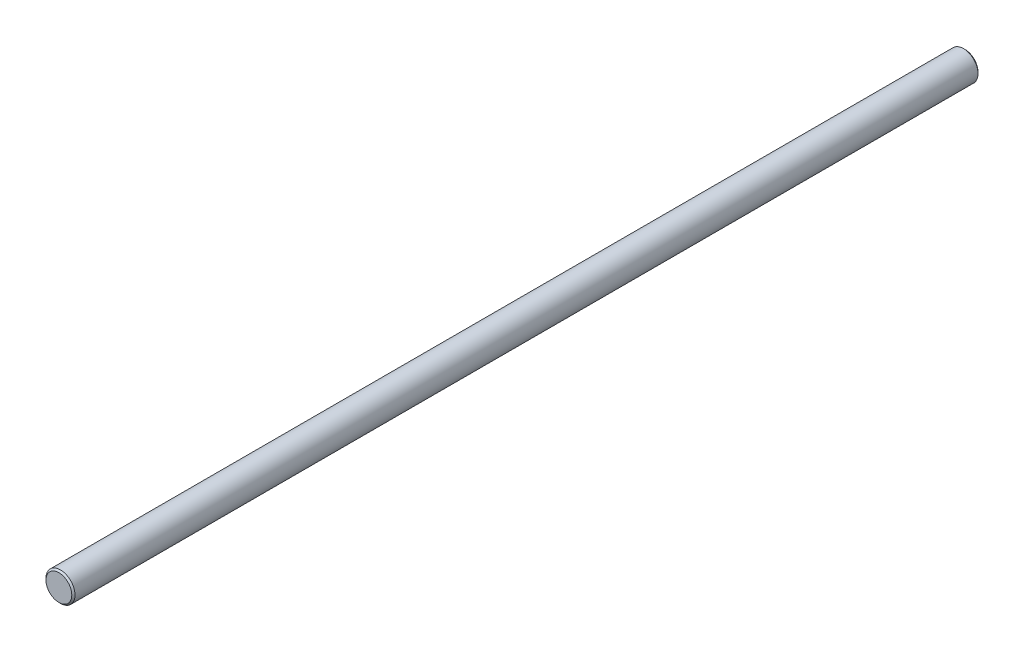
from build123d import *

# Parameters (mm, degrees)
SKETCH_1_R      = 4.5
EXTRUDE_1_DEPTH = 140.5
CHAMFER_1_SIZE  = 0.5


with BuildPart() as part:
    # Sketch 1 → Extrude 1 (new, symmetric)
    with BuildSketch(Plane.XY):
        Circle(SKETCH_1_R)
    extrude(amount=EXTRUDE_1_DEPTH, both=True)

    # Chamfer 1
    chamfer_1_edges = [part.edges().sort_by_distance(p)[0] for p in [
        (-4.5, 0, -140.5),
        (-4.5, 0, 140.5),
    ]]
    chamfer(chamfer_1_edges, length=CHAMFER_1_SIZE)


solid = part.part
